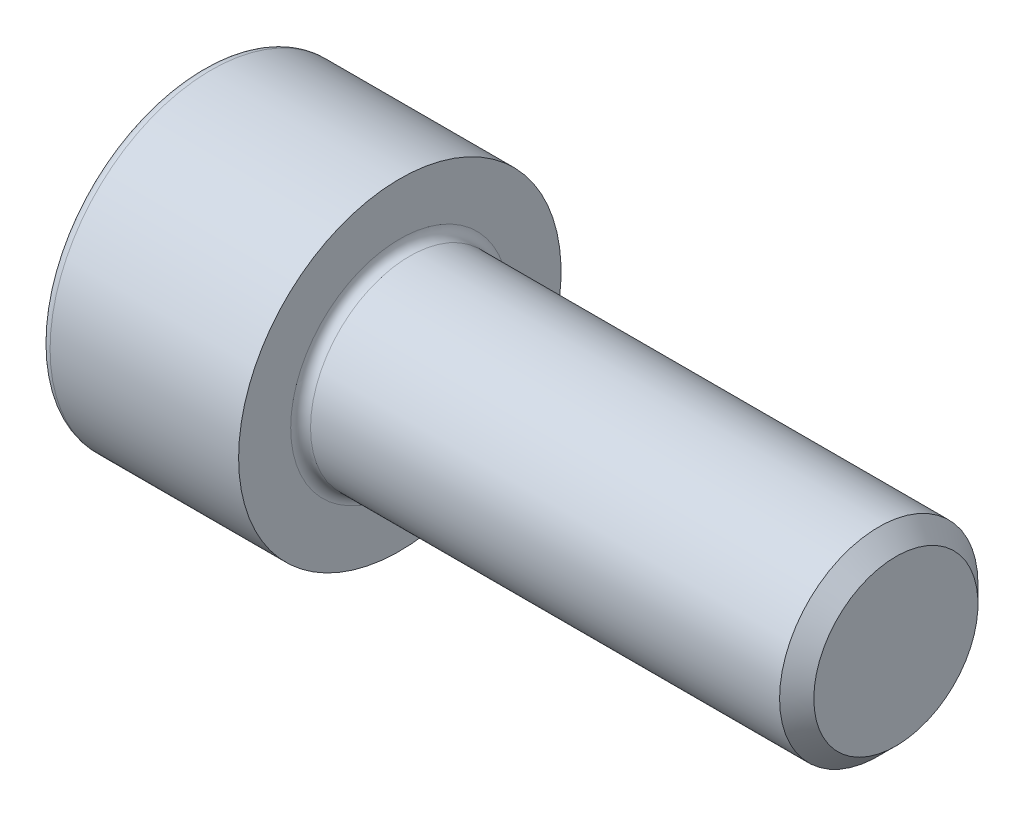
ISO-10303-21;
HEADER;
FILE_DESCRIPTION(('STEP AP214'),'2;1');
FILE_NAME('part.step','',(''),(''),'','','');
FILE_SCHEMA(('AUTOMOTIVE_DESIGN { 1 0 10303 214 1 1 1 1 }'));
ENDSEC;
DATA;
#1=APPLICATION_CONTEXT('core data for automotive mechanical design processes');
#2=APPLICATION_PROTOCOL_DEFINITION('international standard','automotive_design',2000,#1);
#3=PRODUCT_CONTEXT('',#1,'mechanical');
#4=PRODUCT('Part','Part','',(#3));
#5=PRODUCT_RELATED_PRODUCT_CATEGORY('part','',(#4));
#6=PRODUCT_DEFINITION_FORMATION('','',#4);
#7=PRODUCT_DEFINITION_CONTEXT('part definition',#1,'design');
#8=PRODUCT_DEFINITION('design','',#6,#7);
#9=PRODUCT_DEFINITION_SHAPE('','',#8);
#10=(LENGTH_UNIT() NAMED_UNIT(*) SI_UNIT(.MILLI.,.METRE.));
#11=(NAMED_UNIT(*) PLANE_ANGLE_UNIT() SI_UNIT($,.RADIAN.));
#12=(NAMED_UNIT(*) SI_UNIT($,.STERADIAN.) SOLID_ANGLE_UNIT());
#13=UNCERTAINTY_MEASURE_WITH_UNIT(LENGTH_MEASURE(1.E-05),#10,'distance_accuracy_value','');
#14=(GEOMETRIC_REPRESENTATION_CONTEXT(3) GLOBAL_UNCERTAINTY_ASSIGNED_CONTEXT((#13)) GLOBAL_UNIT_ASSIGNED_CONTEXT((#10,
#11,#12)) REPRESENTATION_CONTEXT('',''));
#15=CARTESIAN_POINT('',(0.,0.,0.));
#16=DIRECTION('',(0.,0.,1.));
#17=DIRECTION('',(1.,0.,0.));
#18=AXIS2_PLACEMENT_3D('',#15,#16,#17);
#19=CARTESIAN_POINT('',(4.00000000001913,0.,0.));
#20=DIRECTION('',(-1.,0.,0.));
#21=DIRECTION('',(0.,0.,1.));
#22=AXIS2_PLACEMENT_3D('',#19,#20,#21);
#23=CONICAL_SURFACE('',#22,3.04749999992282,1.04719755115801);
#24=CARTESIAN_POINT('',(5.75947494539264,0.,-2.83939538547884E-11));
#25=VERTEX_POINT('',#24);
#26=VERTEX_LOOP('',#25);
#27=FACE_BOUND('',#26,.T.);
#28=CARTESIAN_POINT('',(4.00000000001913,0.,0.));
#29=DIRECTION('',(-1.,0.,0.));
#30=DIRECTION('',(0.,0.,1.));
#31=AXIS2_PLACEMENT_3D('',#28,#29,#30);
#32=CIRCLE('',#31,3.04749999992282);
#33=CARTESIAN_POINT('',(4.00000000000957,-2.63921241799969,1.52374999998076));
#34=VERTEX_POINT('',#33);
#35=CARTESIAN_POINT('',(3.99999999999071,0.,3.04749999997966));
#36=VERTEX_POINT('',#35);
#37=EDGE_CURVE('E112',#34,#36,#32,.T.);
#38=ORIENTED_EDGE('',*,*,#37,.T.);
#39=CARTESIAN_POINT('',(4.00000000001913,0.,0.));
#40=DIRECTION('',(-1.,0.,0.));
#41=DIRECTION('',(0.,0.,1.));
#42=AXIS2_PLACEMENT_3D('',#39,#40,#41);
#43=CIRCLE('',#42,3.04749999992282);
#44=CARTESIAN_POINT('',(4.00000000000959,2.63921241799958,1.52374999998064));
#45=VERTEX_POINT('',#44);
#46=EDGE_CURVE('E115',#36,#45,#43,.T.);
#47=ORIENTED_EDGE('',*,*,#46,.T.);
#48=CARTESIAN_POINT('',(4.00000000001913,0.,0.));
#49=DIRECTION('',(-1.,0.,0.));
#50=DIRECTION('',(0.,0.,1.));
#51=AXIS2_PLACEMENT_3D('',#48,#49,#50);
#52=CIRCLE('',#51,3.04749999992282);
#53=CARTESIAN_POINT('',(4.00000000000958,2.6392124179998,-1.52374999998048));
#54=VERTEX_POINT('',#53);
#55=EDGE_CURVE('E117',#45,#54,#52,.T.);
#56=ORIENTED_EDGE('',*,*,#55,.T.);
#57=CARTESIAN_POINT('',(4.00000000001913,0.,0.));
#58=DIRECTION('',(-1.,0.,0.));
#59=DIRECTION('',(0.,0.,1.));
#60=AXIS2_PLACEMENT_3D('',#57,#58,#59);
#61=CIRCLE('',#60,3.04749999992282);
#62=CARTESIAN_POINT('',(4.00000000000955,1.11022302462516E-13,-3.04749999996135));
#63=VERTEX_POINT('',#62);
#64=EDGE_CURVE('E131',#54,#63,#61,.T.);
#65=ORIENTED_EDGE('',*,*,#64,.T.);
#66=CARTESIAN_POINT('',(4.00000000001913,0.,0.));
#67=DIRECTION('',(-1.,0.,0.));
#68=DIRECTION('',(0.,0.,1.));
#69=AXIS2_PLACEMENT_3D('',#66,#67,#68);
#70=CIRCLE('',#69,3.04749999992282);
#71=CARTESIAN_POINT('',(4.00000000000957,-2.63921241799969,-1.52374999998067));
#72=VERTEX_POINT('',#71);
#73=EDGE_CURVE('E132',#63,#72,#70,.T.);
#74=ORIENTED_EDGE('',*,*,#73,.T.);
#75=CARTESIAN_POINT('',(4.00000000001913,0.,0.));
#76=DIRECTION('',(-1.,0.,0.));
#77=DIRECTION('',(0.,0.,1.));
#78=AXIS2_PLACEMENT_3D('',#75,#76,#77);
#79=CIRCLE('',#78,3.04749999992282);
#80=EDGE_CURVE('E240',#72,#34,#79,.T.);
#81=ORIENTED_EDGE('',*,*,#80,.T.);
#82=EDGE_LOOP('',(#38,#47,#56,#65,#74,#81));
#83=FACE_BOUND('',#82,.T.);
#84=ADVANCED_FACE('F27',(#27,#83),#23,.F.);
#85=CARTESIAN_POINT('',(4.,3.51894989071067,-1.11022302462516E-13));
#86=DIRECTION('',(1.,0.,0.));
#87=DIRECTION('',(0.,0.,-1.));
#88=AXIS2_PLACEMENT_3D('',#85,#86,#87);
#89=PLANE('',#88);
#90=DIRECTION('',(0.,0.499999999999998,-0.86602540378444));
#91=VECTOR('',#90,1.);
#92=CARTESIAN_POINT('',(4.00000000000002,3.51894989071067,-1.11022302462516E-13));
#93=LINE('',#92,#91);
#94=CARTESIAN_POINT('',(4.00000000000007,1.75947494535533,3.04749999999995));
#95=VERTEX_POINT('',#94);
#96=EDGE_CURVE('E135',#45,#95,#93,.F.);
#97=ORIENTED_EDGE('',*,*,#96,.F.);
#98=ORIENTED_EDGE('',*,*,#46,.F.);
#99=DIRECTION('',(0.,1.,0.));
#100=VECTOR('',#99,1.);
#101=CARTESIAN_POINT('',(4.00000000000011,-1.75947494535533,3.04750000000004));
#102=LINE('',#101,#100);
#103=EDGE_CURVE('E137',#36,#95,#102,.T.);
#104=ORIENTED_EDGE('',*,*,#103,.T.);
#105=EDGE_LOOP('',(#97,#98,#104));
#106=FACE_BOUND('',#105,.T.);
#107=ADVANCED_FACE('F136',(#106),#89,.F.);
#108=CARTESIAN_POINT('',(4.,3.51894989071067,-1.11022302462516E-13));
#109=DIRECTION('',(1.,0.,0.));
#110=DIRECTION('',(0.,0.,-1.));
#111=AXIS2_PLACEMENT_3D('',#108,#109,#110);
#112=PLANE('',#111);
#113=DIRECTION('',(0.,1.,0.));
#114=VECTOR('',#113,1.);
#115=CARTESIAN_POINT('',(4.00000000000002,-1.75947494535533,3.04749999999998));
#116=LINE('',#115,#114);
#117=CARTESIAN_POINT('',(4.00000000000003,-1.75947494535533,3.04749999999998));
#118=VERTEX_POINT('',#117);
#119=EDGE_CURVE('E140',#118,#36,#116,.T.);
#120=ORIENTED_EDGE('',*,*,#119,.T.);
#121=ORIENTED_EDGE('',*,*,#37,.F.);
#122=DIRECTION('',(0.,0.500000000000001,0.866025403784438));
#123=VECTOR('',#122,1.);
#124=CARTESIAN_POINT('',(4.00000000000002,-1.75947494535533,3.04749999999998));
#125=LINE('',#124,#123);
#126=EDGE_CURVE('E193',#118,#34,#125,.F.);
#127=ORIENTED_EDGE('',*,*,#126,.F.);
#128=EDGE_LOOP('',(#120,#121,#127));
#129=FACE_BOUND('',#128,.T.);
#130=ADVANCED_FACE('F499',(#129),#112,.F.);
#131=CARTESIAN_POINT('',(4.,3.51894989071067,-1.11022302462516E-13));
#132=DIRECTION('',(1.,0.,0.));
#133=DIRECTION('',(0.,0.,-1.));
#134=AXIS2_PLACEMENT_3D('',#131,#132,#133);
#135=PLANE('',#134);
#136=DIRECTION('',(0.,0.500000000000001,0.866025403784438));
#137=VECTOR('',#136,1.);
#138=CARTESIAN_POINT('',(4.00000000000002,-1.75947494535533,3.04749999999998));
#139=LINE('',#138,#137);
#140=CARTESIAN_POINT('',(4.00000000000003,-3.51894989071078,-2.22044604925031E-13));
#141=VERTEX_POINT('',#140);
#142=EDGE_CURVE('E189',#34,#141,#139,.F.);
#143=ORIENTED_EDGE('',*,*,#142,.F.);
#144=ORIENTED_EDGE('',*,*,#80,.F.);
#145=DIRECTION('',(0.,-0.499999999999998,0.86602540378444));
#146=VECTOR('',#145,1.);
#147=CARTESIAN_POINT('',(4.00000000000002,-3.51894989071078,-1.11022302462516E-13));
#148=LINE('',#147,#146);
#149=EDGE_CURVE('E176',#141,#72,#148,.F.);
#150=ORIENTED_EDGE('',*,*,#149,.F.);
#151=EDGE_LOOP('',(#143,#144,#150));
#152=FACE_BOUND('',#151,.T.);
#153=ADVANCED_FACE('F491',(#152),#135,.F.);
#154=CARTESIAN_POINT('',(4.,3.51894989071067,-1.11022302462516E-13));
#155=DIRECTION('',(1.,0.,0.));
#156=DIRECTION('',(0.,0.,-1.));
#157=AXIS2_PLACEMENT_3D('',#154,#155,#156);
#158=PLANE('',#157);
#159=DIRECTION('',(0.,-0.499999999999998,0.86602540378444));
#160=VECTOR('',#159,1.);
#161=CARTESIAN_POINT('',(4.00000000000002,-3.51894989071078,-1.11022302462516E-13));
#162=LINE('',#161,#160);
#163=CARTESIAN_POINT('',(4.,-1.75947494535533,-3.0474999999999));
#164=VERTEX_POINT('',#163);
#165=EDGE_CURVE('E173',#72,#164,#162,.F.);
#166=ORIENTED_EDGE('',*,*,#165,.F.);
#167=ORIENTED_EDGE('',*,*,#73,.F.);
#168=DIRECTION('',(0.,1.,0.));
#169=VECTOR('',#168,1.);
#170=CARTESIAN_POINT('',(3.99999999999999,1.75947494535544,-3.04749999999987));
#171=LINE('',#170,#169);
#172=EDGE_CURVE('E167',#63,#164,#171,.F.);
#173=ORIENTED_EDGE('',*,*,#172,.T.);
#174=EDGE_LOOP('',(#166,#167,#173));
#175=FACE_BOUND('',#174,.T.);
#176=ADVANCED_FACE('F484',(#175),#158,.F.);
#177=CARTESIAN_POINT('',(4.,3.51894989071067,-1.11022302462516E-13));
#178=DIRECTION('',(1.,0.,0.));
#179=DIRECTION('',(0.,0.,-1.));
#180=AXIS2_PLACEMENT_3D('',#177,#178,#179);
#181=PLANE('',#180);
#182=DIRECTION('',(0.,0.500000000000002,0.866025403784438));
#183=VECTOR('',#182,1.);
#184=CARTESIAN_POINT('',(4.,3.51894989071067,-1.11022302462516E-13));
#185=LINE('',#184,#183);
#186=CARTESIAN_POINT('',(4.,3.51894989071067,0.));
#187=VERTEX_POINT('',#186);
#188=EDGE_CURVE('E129',#187,#54,#185,.F.);
#189=ORIENTED_EDGE('',*,*,#188,.T.);
#190=ORIENTED_EDGE('',*,*,#55,.F.);
#191=DIRECTION('',(0.,0.499999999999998,-0.86602540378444));
#192=VECTOR('',#191,1.);
#193=CARTESIAN_POINT('',(4.,3.51894989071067,-1.11022302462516E-13));
#194=LINE('',#193,#192);
#195=EDGE_CURVE('E126',#187,#45,#194,.F.);
#196=ORIENTED_EDGE('',*,*,#195,.F.);
#197=EDGE_LOOP('',(#189,#190,#196));
#198=FACE_BOUND('',#197,.T.);
#199=ADVANCED_FACE('F124',(#198),#181,.F.);
#200=CARTESIAN_POINT('',(4.,3.51894989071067,-1.11022302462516E-13));
#201=DIRECTION('',(1.,0.,0.));
#202=DIRECTION('',(0.,0.,-1.));
#203=AXIS2_PLACEMENT_3D('',#200,#201,#202);
#204=PLANE('',#203);
#205=DIRECTION('',(0.,1.,0.));
#206=VECTOR('',#205,1.);
#207=CARTESIAN_POINT('',(3.99999999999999,1.75947494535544,-3.04749999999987));
#208=LINE('',#207,#206);
#209=CARTESIAN_POINT('',(4.00000000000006,1.75947494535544,-3.04749999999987));
#210=VERTEX_POINT('',#209);
#211=EDGE_CURVE('E170',#210,#63,#208,.F.);
#212=ORIENTED_EDGE('',*,*,#211,.T.);
#213=ORIENTED_EDGE('',*,*,#64,.F.);
#214=DIRECTION('',(0.,0.500000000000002,0.866025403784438));
#215=VECTOR('',#214,1.);
#216=CARTESIAN_POINT('',(4.00000000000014,3.51894989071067,-1.38777878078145E-13));
#217=LINE('',#216,#215);
#218=EDGE_CURVE('E327',#54,#210,#217,.F.);
#219=ORIENTED_EDGE('',*,*,#218,.T.);
#220=EDGE_LOOP('',(#212,#213,#219));
#221=FACE_BOUND('',#220,.T.);
#222=ADVANCED_FACE('F470',(#221),#204,.F.);
#223=CARTESIAN_POINT('',(4.,3.51894989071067,-1.11022302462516E-13));
#224=DIRECTION('',(0.,-0.86602540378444,-0.499999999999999));
#225=DIRECTION('',(0.,0.499999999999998,-0.86602540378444));
#226=AXIS2_PLACEMENT_3D('',#223,#224,#225);
#227=PLANE('',#226);
#228=ORIENTED_EDGE('',*,*,#96,.T.);
#229=DIRECTION('',(1.,0.,0.));
#230=VECTOR('',#229,1.);
#231=CARTESIAN_POINT('',(4.00000000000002,1.75947494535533,3.04749999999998));
#232=LINE('',#231,#230);
#233=CARTESIAN_POINT('',(0.,1.75947494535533,3.04749999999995));
#234=VERTEX_POINT('',#233);
#235=EDGE_CURVE('E213',#95,#234,#232,.F.);
#236=ORIENTED_EDGE('',*,*,#235,.T.);
#237=DIRECTION('',(0.,-0.500000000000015,0.86602540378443));
#238=VECTOR('',#237,1.);
#239=CARTESIAN_POINT('',(0.,3.51894989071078,-1.66533453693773E-13));
#240=LINE('',#239,#238);
#241=CARTESIAN_POINT('',(0.,3.51894989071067,0.));
#242=VERTEX_POINT('',#241);
#243=EDGE_CURVE('E153',#242,#234,#240,.T.);
#244=ORIENTED_EDGE('',*,*,#243,.F.);
#245=DIRECTION('',(1.,0.,0.));
#246=VECTOR('',#245,1.);
#247=CARTESIAN_POINT('',(4.00000000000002,3.51894989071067,0.));
#248=LINE('',#247,#246);
#249=EDGE_CURVE('E144',#242,#187,#248,.T.);
#250=ORIENTED_EDGE('',*,*,#249,.T.);
#251=ORIENTED_EDGE('',*,*,#195,.T.);
#252=EDGE_LOOP('',(#228,#236,#244,#250,#251));
#253=FACE_BOUND('',#252,.T.);
#254=ADVANCED_FACE('F142',(#253),#227,.T.);
#255=CARTESIAN_POINT('',(4.00000000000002,-1.75947494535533,3.04749999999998));
#256=DIRECTION('',(0.,0.,1.));
#257=DIRECTION('',(1.,0.,0.));
#258=AXIS2_PLACEMENT_3D('',#255,#256,#257);
#259=PLANE('',#258);
#260=ORIENTED_EDGE('',*,*,#235,.F.);
#261=ORIENTED_EDGE('',*,*,#103,.F.);
#262=ORIENTED_EDGE('',*,*,#119,.F.);
#263=DIRECTION('',(1.,0.,0.));
#264=VECTOR('',#263,1.);
#265=CARTESIAN_POINT('',(4.00000000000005,-1.75947494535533,3.04750000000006));
#266=LINE('',#265,#264);
#267=CARTESIAN_POINT('',(0.,-1.75947494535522,3.04750000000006));
#268=VERTEX_POINT('',#267);
#269=EDGE_CURVE('E208',#268,#118,#266,.T.);
#270=ORIENTED_EDGE('',*,*,#269,.F.);
#271=DIRECTION('',(0.,1.,0.));
#272=VECTOR('',#271,1.);
#273=CARTESIAN_POINT('',(0.,0.,3.0474999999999));
#274=LINE('',#273,#272);
#275=EDGE_CURVE('E156',#234,#268,#274,.F.);
#276=ORIENTED_EDGE('',*,*,#275,.F.);
#277=EDGE_LOOP('',(#260,#261,#262,#270,#276));
#278=FACE_BOUND('',#277,.T.);
#279=ADVANCED_FACE('F455',(#278),#259,.F.);
#280=CARTESIAN_POINT('',(4.00000000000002,-1.75947494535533,3.04749999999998));
#281=DIRECTION('',(0.,0.866025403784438,-0.500000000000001));
#282=DIRECTION('',(0.,0.500000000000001,0.866025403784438));
#283=AXIS2_PLACEMENT_3D('',#280,#281,#282);
#284=PLANE('',#283);
#285=ORIENTED_EDGE('',*,*,#142,.T.);
#286=DIRECTION('',(1.,0.,0.));
#287=VECTOR('',#286,1.);
#288=CARTESIAN_POINT('',(4.00000000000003,-3.51894989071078,-2.22044604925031E-13));
#289=LINE('',#288,#287);
#290=CARTESIAN_POINT('',(0.,-3.51894989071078,-1.38777878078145E-13));
#291=VERTEX_POINT('',#290);
#292=EDGE_CURVE('E184',#291,#141,#289,.T.);
#293=ORIENTED_EDGE('',*,*,#292,.F.);
#294=DIRECTION('',(0.,-0.500000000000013,-0.866025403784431));
#295=VECTOR('',#294,1.);
#296=CARTESIAN_POINT('',(0.,-1.75947494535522,3.04749999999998));
#297=LINE('',#296,#295);
#298=EDGE_CURVE('E199',#268,#291,#297,.T.);
#299=ORIENTED_EDGE('',*,*,#298,.F.);
#300=ORIENTED_EDGE('',*,*,#269,.T.);
#301=ORIENTED_EDGE('',*,*,#126,.T.);
#302=EDGE_LOOP('',(#285,#293,#299,#300,#301));
#303=FACE_BOUND('',#302,.T.);
#304=ADVANCED_FACE('F447',(#303),#284,.T.);
#305=CARTESIAN_POINT('',(4.00000000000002,-3.51894989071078,-1.11022302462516E-13));
#306=DIRECTION('',(0.,0.86602540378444,0.499999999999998));
#307=DIRECTION('',(0.,-0.499999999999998,0.86602540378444));
#308=AXIS2_PLACEMENT_3D('',#305,#306,#307);
#309=PLANE('',#308);
#310=ORIENTED_EDGE('',*,*,#165,.T.);
#311=DIRECTION('',(-1.,0.,0.));
#312=VECTOR('',#311,1.);
#313=CARTESIAN_POINT('',(3.99999999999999,-1.75947494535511,-3.04749999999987));
#314=LINE('',#313,#312);
#315=CARTESIAN_POINT('',(0.,-1.75947494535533,-3.04749999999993));
#316=VERTEX_POINT('',#315);
#317=EDGE_CURVE('E169',#164,#316,#314,.T.);
#318=ORIENTED_EDGE('',*,*,#317,.T.);
#319=DIRECTION('',(0.,0.499999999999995,-0.866025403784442));
#320=VECTOR('',#319,1.);
#321=CARTESIAN_POINT('',(0.,-3.51894989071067,-1.11022302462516E-13));
#322=LINE('',#321,#320);
#323=EDGE_CURVE('E196',#291,#316,#322,.T.);
#324=ORIENTED_EDGE('',*,*,#323,.F.);
#325=ORIENTED_EDGE('',*,*,#292,.T.);
#326=ORIENTED_EDGE('',*,*,#149,.T.);
#327=EDGE_LOOP('',(#310,#318,#324,#325,#326));
#328=FACE_BOUND('',#327,.T.);
#329=ADVANCED_FACE('F440',(#328),#309,.T.);
#330=CARTESIAN_POINT('',(3.99999999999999,1.75947494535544,-3.04749999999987));
#331=DIRECTION('',(0.,0.,-1.));
#332=DIRECTION('',(-1.,0.,0.));
#333=AXIS2_PLACEMENT_3D('',#330,#331,#332);
#334=PLANE('',#333);
#335=ORIENTED_EDGE('',*,*,#317,.F.);
#336=ORIENTED_EDGE('',*,*,#172,.F.);
#337=ORIENTED_EDGE('',*,*,#211,.F.);
#338=DIRECTION('',(1.,0.,0.));
#339=VECTOR('',#338,1.);
#340=CARTESIAN_POINT('',(4.00000000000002,1.75947494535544,-3.0474999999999));
#341=LINE('',#340,#339);
#342=CARTESIAN_POINT('',(0.,1.75947494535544,-3.04749999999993));
#343=VERTEX_POINT('',#342);
#344=EDGE_CURVE('E157',#210,#343,#341,.F.);
#345=ORIENTED_EDGE('',*,*,#344,.T.);
#346=DIRECTION('',(0.,1.,0.));
#347=VECTOR('',#346,1.);
#348=CARTESIAN_POINT('',(0.,0.,-3.04749999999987));
#349=LINE('',#348,#347);
#350=EDGE_CURVE('E164',#316,#343,#349,.T.);
#351=ORIENTED_EDGE('',*,*,#350,.F.);
#352=EDGE_LOOP('',(#335,#336,#337,#345,#351));
#353=FACE_BOUND('',#352,.T.);
#354=ADVANCED_FACE('F345',(#353),#334,.F.);
#355=CARTESIAN_POINT('',(4.,3.51894989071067,-1.11022302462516E-13));
#356=DIRECTION('',(0.,0.866025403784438,-0.500000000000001));
#357=DIRECTION('',(0.,0.500000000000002,0.866025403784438));
#358=AXIS2_PLACEMENT_3D('',#355,#356,#357);
#359=PLANE('',#358);
#360=ORIENTED_EDGE('',*,*,#344,.F.);
#361=ORIENTED_EDGE('',*,*,#218,.F.);
#362=ORIENTED_EDGE('',*,*,#188,.F.);
#363=ORIENTED_EDGE('',*,*,#249,.F.);
#364=DIRECTION('',(0.,0.500000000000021,0.866025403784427));
#365=VECTOR('',#364,1.);
#366=CARTESIAN_POINT('',(0.,1.75947494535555,-3.0474999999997));
#367=LINE('',#366,#365);
#368=EDGE_CURVE('E160',#343,#242,#367,.T.);
#369=ORIENTED_EDGE('',*,*,#368,.F.);
#370=EDGE_LOOP('',(#360,#361,#362,#363,#369));
#371=FACE_BOUND('',#370,.T.);
#372=ADVANCED_FACE('F350',(#371),#359,.F.);
#373=CARTESIAN_POINT('',(0.,0.,0.));
#374=DIRECTION('',(-1.,0.,0.));
#375=DIRECTION('',(0.,0.,1.));
#376=AXIS2_PLACEMENT_3D('',#373,#374,#375);
#377=PLANE('',#376);
#378=CARTESIAN_POINT('',(0.,0.,0.));
#379=DIRECTION('',(1.,0.,0.));
#380=DIRECTION('',(0.,0.,-1.));
#381=AXIS2_PLACEMENT_3D('',#378,#379,#380);
#382=CIRCLE('',#381,6.09999999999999);
#383=CARTESIAN_POINT('',(0.,0.,-6.10000000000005));
#384=VERTEX_POINT('',#383);
#385=CARTESIAN_POINT('',(0.,0.,6.09999999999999));
#386=VERTEX_POINT('',#385);
#387=EDGE_CURVE('E163',#384,#386,#382,.T.);
#388=ORIENTED_EDGE('',*,*,#387,.F.);
#389=CARTESIAN_POINT('',(0.,0.,0.));
#390=DIRECTION('',(1.,0.,0.));
#391=DIRECTION('',(0.,0.,1.));
#392=AXIS2_PLACEMENT_3D('',#389,#390,#391);
#393=CIRCLE('',#392,6.1);
#394=EDGE_CURVE('E365',#386,#384,#393,.T.);
#395=ORIENTED_EDGE('',*,*,#394,.F.);
#396=EDGE_LOOP('',(#388,#395));
#397=FACE_BOUND('',#396,.T.);
#398=ORIENTED_EDGE('',*,*,#350,.T.);
#399=ORIENTED_EDGE('',*,*,#368,.T.);
#400=ORIENTED_EDGE('',*,*,#243,.T.);
#401=ORIENTED_EDGE('',*,*,#275,.T.);
#402=ORIENTED_EDGE('',*,*,#298,.T.);
#403=ORIENTED_EDGE('',*,*,#323,.T.);
#404=EDGE_LOOP('',(#398,#399,#400,#401,#402,#403));
#405=FACE_BOUND('',#404,.T.);
#406=ADVANCED_FACE('F309',(#397,#405),#377,.T.);
#407=CARTESIAN_POINT('',(0.400000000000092,0.,0.));
#408=DIRECTION('',(-1.,0.,0.));
#409=DIRECTION('',(0.,0.,1.));
#410=AXIS2_PLACEMENT_3D('',#407,#408,#409);
#411=TOROIDAL_SURFACE('',#410,6.09999999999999,0.4);
#412=CARTESIAN_POINT('',(0.400000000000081,0.,-1.38777878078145E-13));
#413=DIRECTION('',(-1.,0.,0.));
#414=DIRECTION('',(0.,0.,1.));
#415=AXIS2_PLACEMENT_3D('',#412,#413,#414);
#416=CIRCLE('',#415,6.50000000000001);
#417=CARTESIAN_POINT('',(0.400000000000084,0.,6.49999999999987));
#418=VERTEX_POINT('',#417);
#419=EDGE_CURVE('E237',#418,#418,#416,.F.);
#420=ORIENTED_EDGE('',*,*,#419,.F.);
#421=EDGE_LOOP('',(#420));
#422=FACE_BOUND('',#421,.T.);
#423=ORIENTED_EDGE('',*,*,#394,.T.);
#424=ORIENTED_EDGE('',*,*,#387,.T.);
#425=EDGE_LOOP('',(#423,#424));
#426=FACE_BOUND('',#425,.T.);
#427=ADVANCED_FACE('F304',(#422,#426),#411,.T.);
#428=CARTESIAN_POINT('',(-31.75,-2.22044604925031E-13,-1.11022302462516E-13));
#429=DIRECTION('',(-1.,0.,0.));
#430=DIRECTION('',(0.,0.,1.));
#431=AXIS2_PLACEMENT_3D('',#428,#429,#430);
#432=CYLINDRICAL_SURFACE('',#431,6.50000000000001);
#433=CARTESIAN_POINT('',(7.99999999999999,0.,-1.11022302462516E-13));
#434=DIRECTION('',(-1.,0.,0.));
#435=DIRECTION('',(0.,0.,1.));
#436=AXIS2_PLACEMENT_3D('',#433,#434,#435);
#437=CIRCLE('',#436,6.50000000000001);
#438=CARTESIAN_POINT('',(8.,0.,6.4999999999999));
#439=VERTEX_POINT('',#438);
#440=EDGE_CURVE('E235',#439,#439,#437,.F.);
#441=ORIENTED_EDGE('',*,*,#440,.F.);
#442=EDGE_LOOP('',(#441));
#443=FACE_BOUND('',#442,.T.);
#444=ORIENTED_EDGE('',*,*,#419,.T.);
#445=EDGE_LOOP('',(#444));
#446=FACE_BOUND('',#445,.T.);
#447=ADVANCED_FACE('F308',(#443,#446),#432,.T.);
#448=CARTESIAN_POINT('',(28.0000000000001,3.30949999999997,-2.22044604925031E-13));
#449=DIRECTION('',(1.,0.,0.));
#450=DIRECTION('',(0.,0.,-1.));
#451=AXIS2_PLACEMENT_3D('',#448,#449,#450);
#452=PLANE('',#451);
#453=CARTESIAN_POINT('',(28.0000000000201,-1.11022302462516E-13,-1.11022302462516E-13));
#454=DIRECTION('',(-1.,0.,0.));
#455=DIRECTION('',(0.,0.,1.));
#456=AXIS2_PLACEMENT_3D('',#453,#454,#455);
#457=CIRCLE('',#456,3.30950000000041);
#458=CARTESIAN_POINT('',(28.0000000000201,-1.11022302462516E-13,3.3095000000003));
#459=VERTEX_POINT('',#458);
#460=EDGE_CURVE('E231',#459,#459,#457,.T.);
#461=ORIENTED_EDGE('',*,*,#460,.F.);
#462=EDGE_LOOP('',(#461));
#463=FACE_BOUND('',#462,.T.);
#464=ADVANCED_FACE('F281',(#463),#452,.T.);
#465=CARTESIAN_POINT('',(7.99999999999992,6.49999999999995,0.));
#466=DIRECTION('',(1.,0.,0.));
#467=DIRECTION('',(0.,0.,-1.));
#468=AXIS2_PLACEMENT_3D('',#465,#466,#467);
#469=PLANE('',#468);
#470=ORIENTED_EDGE('',*,*,#440,.T.);
#471=EDGE_LOOP('',(#470));
#472=FACE_BOUND('',#471,.T.);
#473=CARTESIAN_POINT('',(8.00000000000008,0.,1.11199938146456E-13));
#474=DIRECTION('',(1.,0.,0.));
#475=DIRECTION('',(0.,0.,1.));
#476=AXIS2_PLACEMENT_3D('',#473,#474,#475);
#477=CIRCLE('',#476,4.39999999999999);
#478=CARTESIAN_POINT('',(8.00000000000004,0.,-4.3999999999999));
#479=VERTEX_POINT('',#478);
#480=CARTESIAN_POINT('',(7.99999999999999,0.,4.40000000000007));
#481=VERTEX_POINT('',#480);
#482=EDGE_CURVE('E234',#479,#481,#477,.F.);
#483=ORIENTED_EDGE('',*,*,#482,.T.);
#484=CARTESIAN_POINT('',(8.00000000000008,0.,1.11199938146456E-13));
#485=DIRECTION('',(1.,0.,0.));
#486=DIRECTION('',(0.,0.,-1.));
#487=AXIS2_PLACEMENT_3D('',#484,#485,#486);
#488=CIRCLE('',#487,4.39999999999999);
#489=EDGE_CURVE('E46',#481,#479,#488,.F.);
#490=ORIENTED_EDGE('',*,*,#489,.T.);
#491=EDGE_LOOP('',(#483,#490));
#492=FACE_BOUND('',#491,.T.);
#493=ADVANCED_FACE('F272',(#472,#492),#469,.T.);
#494=CARTESIAN_POINT('',(27.3094999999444,-1.11022302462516E-13,-1.11022302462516E-13));
#495=DIRECTION('',(-1.,0.,0.));
#496=DIRECTION('',(0.,0.,1.));
#497=AXIS2_PLACEMENT_3D('',#494,#495,#496);
#498=CONICAL_SURFACE('',#497,4.00000000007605,0.785398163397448);
#499=CARTESIAN_POINT('',(27.3095,0.,-1.38777878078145E-13));
#500=DIRECTION('',(-1.,0.,0.));
#501=DIRECTION('',(0.,0.,1.));
#502=AXIS2_PLACEMENT_3D('',#499,#500,#501);
#503=CIRCLE('',#502,3.99999999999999);
#504=CARTESIAN_POINT('',(27.3095,0.,3.99999999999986));
#505=VERTEX_POINT('',#504);
#506=EDGE_CURVE('E38',#505,#505,#503,.T.);
#507=ORIENTED_EDGE('',*,*,#506,.F.);
#508=EDGE_LOOP('',(#507));
#509=FACE_BOUND('',#508,.T.);
#510=ORIENTED_EDGE('',*,*,#460,.T.);
#511=EDGE_LOOP('',(#510));
#512=FACE_BOUND('',#511,.T.);
#513=ADVANCED_FACE('F260',(#509,#512),#498,.T.);
#514=CARTESIAN_POINT('',(8.40000000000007,0.,1.11022302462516E-13));
#515=DIRECTION('',(1.,0.,0.));
#516=DIRECTION('',(0.,0.,-1.));
#517=AXIS2_PLACEMENT_3D('',#514,#515,#516);
#518=TOROIDAL_SURFACE('',#517,4.39999999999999,0.4);
#519=CARTESIAN_POINT('',(8.40000000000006,0.,-1.38777878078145E-13));
#520=DIRECTION('',(-1.,0.,0.));
#521=DIRECTION('',(0.,0.,1.));
#522=AXIS2_PLACEMENT_3D('',#519,#520,#521);
#523=CIRCLE('',#522,3.99999999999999);
#524=CARTESIAN_POINT('',(8.40000000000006,0.,3.99999999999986));
#525=VERTEX_POINT('',#524);
#526=EDGE_CURVE('E13',#525,#525,#523,.F.);
#527=ORIENTED_EDGE('',*,*,#526,.F.);
#528=EDGE_LOOP('',(#527));
#529=FACE_BOUND('',#528,.T.);
#530=ORIENTED_EDGE('',*,*,#482,.F.);
#531=ORIENTED_EDGE('',*,*,#489,.F.);
#532=EDGE_LOOP('',(#530,#531));
#533=FACE_BOUND('',#532,.T.);
#534=ADVANCED_FACE('F248',(#529,#533),#518,.F.);
#535=CARTESIAN_POINT('',(-31.75,-2.22044604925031E-13,-1.11022302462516E-13));
#536=DIRECTION('',(-1.,0.,0.));
#537=DIRECTION('',(0.,0.,1.));
#538=AXIS2_PLACEMENT_3D('',#535,#536,#537);
#539=CYLINDRICAL_SURFACE('',#538,3.99999999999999);
#540=ORIENTED_EDGE('',*,*,#526,.T.);
#541=EDGE_LOOP('',(#540));
#542=FACE_BOUND('',#541,.T.);
#543=ORIENTED_EDGE('',*,*,#506,.T.);
#544=EDGE_LOOP('',(#543));
#545=FACE_BOUND('',#544,.T.);
#546=ADVANCED_FACE('F259',(#542,#545),#539,.T.);
#547=CLOSED_SHELL('',(#84,#107,#130,#153,#176,#199,#222,#254,#279,#304,#329,#354,#372,#406,#427,
#447,#464,#493,#513,#534,#546));
#548=MANIFOLD_SOLID_BREP('B1',#547);
#549=ADVANCED_BREP_SHAPE_REPRESENTATION('',(#18,#548),#14);
#550=SHAPE_DEFINITION_REPRESENTATION(#9,#549);
ENDSEC;
END-ISO-10303-21;
